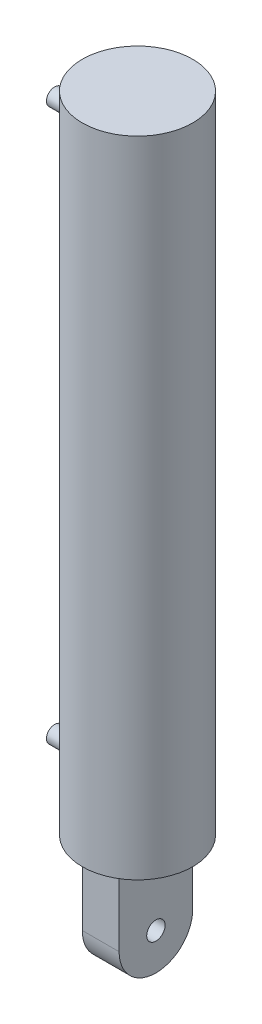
ISO-10303-21;
HEADER;
FILE_DESCRIPTION(('STEP AP214'),'2;1');
FILE_NAME('part.step','',(''),(''),'','','');
FILE_SCHEMA(('AUTOMOTIVE_DESIGN { 1 0 10303 214 1 1 1 1 }'));
ENDSEC;
DATA;
#1=APPLICATION_CONTEXT('core data for automotive mechanical design processes');
#2=APPLICATION_PROTOCOL_DEFINITION('international standard','automotive_design',2000,#1);
#3=PRODUCT_CONTEXT('',#1,'mechanical');
#4=PRODUCT('Part','Part','',(#3));
#5=PRODUCT_RELATED_PRODUCT_CATEGORY('part','',(#4));
#6=PRODUCT_DEFINITION_FORMATION('','',#4);
#7=PRODUCT_DEFINITION_CONTEXT('part definition',#1,'design');
#8=PRODUCT_DEFINITION('design','',#6,#7);
#9=PRODUCT_DEFINITION_SHAPE('','',#8);
#10=(LENGTH_UNIT() NAMED_UNIT(*) SI_UNIT(.MILLI.,.METRE.));
#11=(NAMED_UNIT(*) PLANE_ANGLE_UNIT() SI_UNIT($,.RADIAN.));
#12=(NAMED_UNIT(*) SI_UNIT($,.STERADIAN.) SOLID_ANGLE_UNIT());
#13=UNCERTAINTY_MEASURE_WITH_UNIT(LENGTH_MEASURE(1.E-05),#10,'distance_accuracy_value','');
#14=(GEOMETRIC_REPRESENTATION_CONTEXT(3) GLOBAL_UNCERTAINTY_ASSIGNED_CONTEXT((#13)) GLOBAL_UNIT_ASSIGNED_CONTEXT((#10,
#11,#12)) REPRESENTATION_CONTEXT('',''));
#15=CARTESIAN_POINT('',(0.,0.,0.));
#16=DIRECTION('',(0.,0.,1.));
#17=DIRECTION('',(1.,0.,0.));
#18=AXIS2_PLACEMENT_3D('',#15,#16,#17);
#19=CARTESIAN_POINT('',(0.,0.,0.));
#20=DIRECTION('',(0.,1.,0.));
#21=DIRECTION('',(0.,0.,1.));
#22=AXIS2_PLACEMENT_3D('',#19,#20,#21);
#23=PLANE('',#22);
#24=CARTESIAN_POINT('',(0.,0.,0.));
#25=DIRECTION('',(0.,1.,0.));
#26=DIRECTION('',(0.,0.,1.));
#27=AXIS2_PLACEMENT_3D('',#24,#25,#26);
#28=CIRCLE('',#27,60.);
#29=CARTESIAN_POINT('',(0.,0.,60.));
#30=VERTEX_POINT('',#29);
#31=EDGE_CURVE('E133',#30,#30,#28,.T.);
#32=ORIENTED_EDGE('',*,*,#31,.F.);
#33=EDGE_LOOP('',(#32));
#34=FACE_BOUND('',#33,.T.);
#35=DIRECTION('',(-1.,0.,0.));
#36=VECTOR('',#35,1.);
#37=CARTESIAN_POINT('',(-20.,0.,40.));
#38=LINE('',#37,#36);
#39=CARTESIAN_POINT('',(20.,0.,40.));
#40=VERTEX_POINT('',#39);
#41=CARTESIAN_POINT('',(-20.,0.,40.));
#42=VERTEX_POINT('',#41);
#43=EDGE_CURVE('E119',#40,#42,#38,.T.);
#44=ORIENTED_EDGE('',*,*,#43,.F.);
#45=DIRECTION('',(0.,0.,-1.));
#46=VECTOR('',#45,1.);
#47=CARTESIAN_POINT('',(20.,0.,40.));
#48=LINE('',#47,#46);
#49=CARTESIAN_POINT('',(20.,0.,-40.));
#50=VERTEX_POINT('',#49);
#51=EDGE_CURVE('E126',#40,#50,#48,.T.);
#52=ORIENTED_EDGE('',*,*,#51,.T.);
#53=DIRECTION('',(-1.,0.,0.));
#54=VECTOR('',#53,1.);
#55=CARTESIAN_POINT('',(-20.,0.,-40.));
#56=LINE('',#55,#54);
#57=CARTESIAN_POINT('',(-20.,0.,-40.));
#58=VERTEX_POINT('',#57);
#59=EDGE_CURVE('E144',#50,#58,#56,.T.);
#60=ORIENTED_EDGE('',*,*,#59,.T.);
#61=DIRECTION('',(0.,0.,-1.));
#62=VECTOR('',#61,1.);
#63=CARTESIAN_POINT('',(-20.,0.,40.));
#64=LINE('',#63,#62);
#65=EDGE_CURVE('E134',#42,#58,#64,.T.);
#66=ORIENTED_EDGE('',*,*,#65,.F.);
#67=EDGE_LOOP('',(#44,#52,#60,#66));
#68=FACE_BOUND('',#67,.T.);
#69=ADVANCED_FACE('F65',(#34,#68),#23,.F.);
#70=CARTESIAN_POINT('',(0.,700.,0.));
#71=DIRECTION('',(0.,-1.,0.));
#72=DIRECTION('',(0.,0.,-1.));
#73=AXIS2_PLACEMENT_3D('',#70,#71,#72);
#74=CYLINDRICAL_SURFACE('',#73,60.);
#75=CARTESIAN_POINT('',(-59.3211597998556,50.,-8.99999999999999));
#76=CARTESIAN_POINT('',(-59.3211583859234,50.2513237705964,-9.00000343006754));
#77=CARTESIAN_POINT('',(-59.3227601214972,50.5025995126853,-8.98946923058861));
#78=CARTESIAN_POINT('',(-59.3291177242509,51.0034271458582,-8.94741688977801));
#79=CARTESIAN_POINT('',(-59.3338742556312,51.2529786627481,-8.9158943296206));
#80=CARTESIAN_POINT('',(-59.3464108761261,51.7487007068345,-8.83206107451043));
#81=CARTESIAN_POINT('',(-59.3541935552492,51.9948681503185,-8.77973257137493));
#82=CARTESIAN_POINT('',(-59.3725563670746,52.4818658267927,-8.65468318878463));
#83=CARTESIAN_POINT('',(-59.3831365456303,52.7226959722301,-8.58196197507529));
#84=CARTESIAN_POINT('',(-59.4067802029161,53.1971284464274,-8.41673441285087));
#85=CARTESIAN_POINT('',(-59.4198417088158,53.430736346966,-8.32424377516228));
#86=CARTESIAN_POINT('',(-59.4480806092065,53.8893016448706,-8.12011829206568));
#87=CARTESIAN_POINT('',(-59.4632580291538,54.1142589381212,-8.00848321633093));
#88=CARTESIAN_POINT('',(-59.4952933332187,54.5538978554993,-7.76691084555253));
#89=CARTESIAN_POINT('',(-59.5121506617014,54.7685828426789,-7.63697959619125));
#90=CARTESIAN_POINT('',(-59.5470823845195,55.1863643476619,-7.35965424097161));
#91=CARTESIAN_POINT('',(-59.5651572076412,55.3894567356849,-7.21225396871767));
#92=CARTESIAN_POINT('',(-59.6021384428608,55.7839203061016,-6.89999774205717));
#93=CARTESIAN_POINT('',(-59.6210496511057,55.9752029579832,-6.73503050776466));
#94=CARTESIAN_POINT('',(-59.6590645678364,56.3433053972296,-6.38954003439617));
#95=CARTESIAN_POINT('',(-59.6781683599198,56.5201185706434,-6.20900975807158));
#96=CARTESIAN_POINT('',(-59.7160244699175,56.8579710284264,-5.83369420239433));
#97=CARTESIAN_POINT('',(-59.7347767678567,57.0190094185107,-5.63890811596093));
#98=CARTESIAN_POINT('',(-59.7713944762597,57.3241061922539,-5.23652450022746));
#99=CARTESIAN_POINT('',(-59.7892602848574,57.4681722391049,-5.02893281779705));
#100=CARTESIAN_POINT('',(-59.8237032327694,57.739097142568,-4.60117412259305));
#101=CARTESIAN_POINT('',(-59.8402731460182,57.8658620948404,-4.38094703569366));
#102=CARTESIAN_POINT('',(-59.8715441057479,58.1003268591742,-3.93053961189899));
#103=CARTESIAN_POINT('',(-59.8862458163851,58.2080334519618,-3.70036285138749));
#104=CARTESIAN_POINT('',(-59.9133710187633,58.4036550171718,-3.2315781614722));
#105=CARTESIAN_POINT('',(-59.9257941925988,58.4915672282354,-2.99296906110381));
#106=CARTESIAN_POINT('',(-59.9480048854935,58.6469188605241,-2.50905734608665));
#107=CARTESIAN_POINT('',(-59.9577924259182,58.7143584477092,-2.26375478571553));
#108=CARTESIAN_POINT('',(-59.9743889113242,58.8278227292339,-1.77008745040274));
#109=CARTESIAN_POINT('',(-59.9812196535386,58.8740043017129,-1.52175946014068));
#110=CARTESIAN_POINT('',(-59.9918152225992,58.9453418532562,-1.02203742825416));
#111=CARTESIAN_POINT('',(-59.9955800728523,58.9704979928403,-0.77064341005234));
#112=CARTESIAN_POINT('',(-59.9999369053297,58.9995909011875,-0.266615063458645));
#113=CARTESIAN_POINT('',(-60.0005290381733,59.0035286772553,-0.0139807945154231));
#114=CARTESIAN_POINT('',(-59.9985239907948,58.9901570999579,0.490711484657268));
#115=CARTESIAN_POINT('',(-59.9959268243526,58.9728478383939,0.742769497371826));
#116=CARTESIAN_POINT('',(-59.9876512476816,58.9173452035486,1.2424250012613));
#117=CARTESIAN_POINT('',(-59.9819983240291,58.8793245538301,1.490042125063));
#118=CARTESIAN_POINT('',(-59.9677833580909,58.7827853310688,1.98125077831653));
#119=CARTESIAN_POINT('',(-59.959220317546,58.724259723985,2.22484089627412));
#120=CARTESIAN_POINT('',(-59.9394255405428,58.5871607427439,2.70615509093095));
#121=CARTESIAN_POINT('',(-59.928194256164,58.5085907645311,2.94388015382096));
#122=CARTESIAN_POINT('',(-59.9033732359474,58.3319723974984,3.41185995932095));
#123=CARTESIAN_POINT('',(-59.8897834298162,58.2339234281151,3.64211447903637));
#124=CARTESIAN_POINT('',(-59.8605661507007,58.0186525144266,4.09440774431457));
#125=CARTESIAN_POINT('',(-59.8449312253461,57.9013600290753,4.31641243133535));
#126=CARTESIAN_POINT('',(-59.8120967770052,57.6486994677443,4.74976921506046));
#127=CARTESIAN_POINT('',(-59.7948972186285,57.5133309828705,4.96112107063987));
#128=CARTESIAN_POINT('',(-59.7594088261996,57.2254645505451,5.37173459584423));
#129=CARTESIAN_POINT('',(-59.7411199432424,57.0729658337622,5.57099572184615));
#130=CARTESIAN_POINT('',(-59.7039590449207,56.7518992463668,5.95606398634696));
#131=CARTESIAN_POINT('',(-59.6850870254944,56.5833312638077,6.14187103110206));
#132=CARTESIAN_POINT('',(-59.647095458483,56.229544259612,6.50052695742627));
#133=CARTESIAN_POINT('',(-59.6279753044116,56.0441775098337,6.67323008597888));
#134=CARTESIAN_POINT('',(-59.5902138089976,55.6595234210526,7.00241924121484));
#135=CARTESIAN_POINT('',(-59.571572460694,55.4602362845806,7.1589055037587));
#136=CARTESIAN_POINT('',(-59.5352972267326,55.0491122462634,7.45456750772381));
#137=CARTESIAN_POINT('',(-59.5176633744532,54.837274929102,7.59374267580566));
#138=CARTESIAN_POINT('',(-59.4839084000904,54.402534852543,7.85377865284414));
#139=CARTESIAN_POINT('',(-59.4677872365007,54.1796323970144,7.97463996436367));
#140=CARTESIAN_POINT('',(-59.4375064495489,53.7240924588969,8.19728427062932));
#141=CARTESIAN_POINT('',(-59.4233487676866,53.4914456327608,8.29904841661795));
#142=CARTESIAN_POINT('',(-59.3974300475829,53.0183530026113,8.48256419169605));
#143=CARTESIAN_POINT('',(-59.385668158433,52.7779100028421,8.56432292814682));
#144=CARTESIAN_POINT('',(-59.3648778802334,52.2908358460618,8.70726690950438));
#145=CARTESIAN_POINT('',(-59.3558498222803,52.0442039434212,8.76844966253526));
#146=CARTESIAN_POINT('',(-59.3407954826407,51.5465629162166,8.86975867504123));
#147=CARTESIAN_POINT('',(-59.3347691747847,51.2955538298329,8.90988511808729));
#148=CARTESIAN_POINT('',(-59.325939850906,50.7934345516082,8.96848543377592));
#149=CARTESIAN_POINT('',(-59.3231061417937,50.5423489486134,8.98716552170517));
#150=CARTESIAN_POINT('',(-59.3206401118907,50.039480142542,9.00342854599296));
#151=CARTESIAN_POINT('',(-59.321007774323,49.787696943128,9.00101159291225));
#152=CARTESIAN_POINT('',(-59.3249336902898,49.2852507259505,8.97509960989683));
#153=CARTESIAN_POINT('',(-59.3284918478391,49.0345876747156,8.95160521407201));
#154=CARTESIAN_POINT('',(-59.3386948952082,48.5361718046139,8.88371901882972));
#155=CARTESIAN_POINT('',(-59.3453397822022,48.2884189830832,8.83932723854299));
#156=CARTESIAN_POINT('',(-59.3614811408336,47.7988664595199,8.73026770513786));
#157=CARTESIAN_POINT('',(-59.3709626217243,47.5570425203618,8.66570646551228));
#158=CARTESIAN_POINT('',(-59.3925218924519,47.079632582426,8.51668993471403));
#159=CARTESIAN_POINT('',(-59.4046005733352,46.8440487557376,8.43222781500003));
#160=CARTESIAN_POINT('',(-59.4310072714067,46.3808725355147,8.24405200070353));
#161=CARTESIAN_POINT('',(-59.4453349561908,46.1532789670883,8.14034115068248));
#162=CARTESIAN_POINT('',(-59.4758376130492,45.7076003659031,7.91440004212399));
#163=CARTESIAN_POINT('',(-59.4920126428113,45.4895156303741,7.79216920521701));
#164=CARTESIAN_POINT('',(-59.5258841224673,45.0627463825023,7.52906607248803));
#165=CARTESIAN_POINT('',(-59.5435910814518,44.8541447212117,7.38806073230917));
#166=CARTESIAN_POINT('',(-59.5799220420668,44.4495297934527,7.08911513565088));
#167=CARTESIAN_POINT('',(-59.5985460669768,44.2535168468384,6.93117444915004));
#168=CARTESIAN_POINT('',(-59.6361896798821,43.8754171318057,6.59944976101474));
#169=CARTESIAN_POINT('',(-59.6552092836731,43.6933309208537,6.42566512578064));
#170=CARTESIAN_POINT('',(-59.6931126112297,43.3443413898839,6.06345257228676));
#171=CARTESIAN_POINT('',(-59.7119963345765,43.1774381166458,5.87502460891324));
#172=CARTESIAN_POINT('',(-59.7492573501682,42.8586393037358,5.48318258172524));
#173=CARTESIAN_POINT('',(-59.7676290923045,42.7068808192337,5.27965645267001));
#174=CARTESIAN_POINT('',(-59.8031797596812,42.4210537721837,4.86044564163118));
#175=CARTESIAN_POINT('',(-59.8203587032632,42.2869849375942,4.64476114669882));
#176=CARTESIAN_POINT('',(-59.8530375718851,42.0374998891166,4.20273703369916));
#177=CARTESIAN_POINT('',(-59.8685374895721,41.9220837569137,3.97639736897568));
#178=CARTESIAN_POINT('',(-59.8974175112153,41.7107546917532,3.5146654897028));
#179=CARTESIAN_POINT('',(-59.9107976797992,41.6148411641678,3.27927355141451));
#180=CARTESIAN_POINT('',(-59.9350149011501,41.443529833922,2.80194405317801));
#181=CARTESIAN_POINT('',(-59.9458606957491,41.3680613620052,2.56003230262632));
#182=CARTESIAN_POINT('',(-59.964757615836,41.2377906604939,2.07069292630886));
#183=CARTESIAN_POINT('',(-59.9728097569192,41.1829809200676,1.82326733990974));
#184=CARTESIAN_POINT('',(-59.9858962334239,41.0944023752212,1.32456638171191));
#185=CARTESIAN_POINT('',(-59.9909301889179,41.0606362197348,1.07329052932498));
#186=CARTESIAN_POINT('',(-59.9978348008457,41.0144168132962,0.568743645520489));
#187=CARTESIAN_POINT('',(-59.9997054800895,41.0019634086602,0.31547262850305));
#188=CARTESIAN_POINT('',(-60.0002275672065,40.9984829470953,-0.188685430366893));
#189=CARTESIAN_POINT('',(-59.9989109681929,41.0072429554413,-0.439570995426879));
#190=CARTESIAN_POINT('',(-59.9931611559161,41.0456856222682,-0.9397865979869));
#191=CARTESIAN_POINT('',(-59.9887268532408,41.0753755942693,-1.18911606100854));
#192=CARTESIAN_POINT('',(-59.9768659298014,41.1554530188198,-1.68430493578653));
#193=CARTESIAN_POINT('',(-59.969439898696,41.2058363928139,-1.93016502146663));
#194=CARTESIAN_POINT('',(-59.9518029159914,41.326923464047,-2.41673292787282));
#195=CARTESIAN_POINT('',(-59.9415918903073,41.397627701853,-2.6574406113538));
#196=CARTESIAN_POINT('',(-59.918678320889,41.5587701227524,-3.1318274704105));
#197=CARTESIAN_POINT('',(-59.9059776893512,41.6491931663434,-3.36551188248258));
#198=CARTESIAN_POINT('',(-59.8784317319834,41.8491481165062,-3.82442967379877));
#199=CARTESIAN_POINT('',(-59.8635863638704,41.958680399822,-4.04966288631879));
#200=CARTESIAN_POINT('',(-59.8321609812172,42.19607007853,-4.49013029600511));
#201=CARTESIAN_POINT('',(-59.8155809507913,42.3239276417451,-4.70536440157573));
#202=CARTESIAN_POINT('',(-59.7811428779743,42.5970687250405,-5.12436852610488));
#203=CARTESIAN_POINT('',(-59.763284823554,42.7423524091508,-5.32813843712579));
#204=CARTESIAN_POINT('',(-59.7266105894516,43.0507792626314,-5.72468463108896));
#205=CARTESIAN_POINT('',(-59.7077869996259,43.2140770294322,-5.91734000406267));
#206=CARTESIAN_POINT('',(-59.6698656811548,43.5562608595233,-6.28823414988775));
#207=CARTESIAN_POINT('',(-59.6507679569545,43.7351466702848,-6.4664731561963));
#208=CARTESIAN_POINT('',(-59.6128290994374,44.1073213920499,-6.80735135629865));
#209=CARTESIAN_POINT('',(-59.5939880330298,44.3006139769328,-6.9699865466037));
#210=CARTESIAN_POINT('',(-59.5570989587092,44.700225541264,-7.27846841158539));
#211=CARTESIAN_POINT('',(-59.5390509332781,44.9065442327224,-7.42431545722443));
#212=CARTESIAN_POINT('',(-59.5041574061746,45.3320289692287,-7.69899598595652));
#213=CARTESIAN_POINT('',(-59.4873195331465,45.5512629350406,-7.82772526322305));
#214=CARTESIAN_POINT('',(-59.4554551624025,45.999852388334,-8.06618387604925));
#215=CARTESIAN_POINT('',(-59.4404279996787,46.2292041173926,-8.17592019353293));
#216=CARTESIAN_POINT('',(-59.4126250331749,46.6963195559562,-8.37556870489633));
#217=CARTESIAN_POINT('',(-59.3998475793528,46.9340769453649,-8.46549544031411));
#218=CARTESIAN_POINT('',(-59.3769065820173,47.4163806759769,-8.62493085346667));
#219=CARTESIAN_POINT('',(-59.3667424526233,47.6609254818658,-8.69444410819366));
#220=CARTESIAN_POINT('',(-59.3459809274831,48.2501176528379,-8.83524234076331));
#221=CARTESIAN_POINT('',(-59.3367159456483,48.597144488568,-8.89695732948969));
#222=CARTESIAN_POINT('',(-59.3243064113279,49.2961456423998,-8.97933349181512));
#223=CARTESIAN_POINT('',(-59.3211617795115,49.6481198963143,-8.99999519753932));
#224=CARTESIAN_POINT('',(-59.3211597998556,50.,-8.99999999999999));
#225=B_SPLINE_CURVE_WITH_KNOTS('',3,(#75,#76,#77,#78,#79,#80,#81,#82,#83,#84,#85,#86,#87,#88,
#89,#90,#91,#92,#93,#94,#95,#96,#97,#98,#99,#100,#101,#102,#103,#104,#105,#106,#107,#108,#109,
#110,#111,#112,#113,#114,#115,#116,#117,#118,#119,#120,#121,#122,#123,#124,#125,#126,#127,#128,
#129,#130,#131,#132,#133,#134,#135,#136,#137,#138,#139,#140,#141,#142,#143,#144,#145,#146,#147,
#148,#149,#150,#151,#152,#153,#154,#155,#156,#157,#158,#159,#160,#161,#162,#163,#164,#165,#166,
#167,#168,#169,#170,#171,#172,#173,#174,#175,#176,#177,#178,#179,#180,#181,#182,#183,#184,#185,
#186,#187,#188,#189,#190,#191,#192,#193,#194,#195,#196,#197,#198,#199,#200,#201,#202,#203,#204,
#205,#206,#207,#208,#209,#210,#211,#212,#213,#214,#215,#216,#217,#218,#219,#220,#221,#222,#223,
#224),.UNSPECIFIED.,.T.,.F.,(4,2,2,2,2,2,2,2,2,2,2,2,2,2,2,2,2,2,2,2,2,2,2,2,2,2,2,2,2,2,2,2,2,
2,2,2,2,2,2,2,2,2,2,2,2,2,2,2,2,2,2,2,2,2,2,2,2,2,2,2,2,2,2,2,2,2,2,2,2,2,2,2,2,2,4),(0.,
0.753662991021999,1.50748470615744,2.26195302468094,3.01643371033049,3.77031702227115,
4.5242094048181,5.27785325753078,6.03176393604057,6.79077179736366,7.55012468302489,
8.30952059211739,9.06857230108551,9.83159263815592,10.594340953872,11.3571956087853,
12.1200440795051,12.8771689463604,13.6342880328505,14.3913711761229,15.1484510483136,
15.8993117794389,16.6504303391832,17.4014217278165,18.1524355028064,18.9062664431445,
19.6601144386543,20.4139963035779,21.1678834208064,21.9292003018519,22.6905061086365,
23.4518371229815,24.2131472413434,24.975204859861,25.7369913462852,26.4988700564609,
27.2607421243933,28.0152254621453,28.7697048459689,29.5241615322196,30.2786175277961,
31.0291547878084,31.7799499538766,32.5306342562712,33.2813420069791,34.0376849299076,
34.7940470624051,35.5504394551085,36.3068341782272,37.0695492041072,37.8322524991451,
38.5949591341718,39.3576425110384,40.1176549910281,40.8773908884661,41.6372224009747,
42.3970484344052,43.1492792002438,43.901772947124,44.65411845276,45.4064839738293,
46.1582738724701,46.9100785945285,47.6618902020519,48.4137088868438,49.172572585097,
49.9314239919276,50.6904695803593,51.4494983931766,52.2129547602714,52.9761298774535,
53.7387428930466,54.5011847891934,55.5564070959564,56.6116157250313),.UNSPECIFIED.);
#226=CARTESIAN_POINT('',(-59.3211597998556,50.,-8.99999999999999));
#227=VERTEX_POINT('',#226);
#228=EDGE_CURVE('E69',#227,#227,#225,.T.);
#229=ORIENTED_EDGE('',*,*,#228,.T.);
#230=EDGE_LOOP('',(#229));
#231=FACE_BOUND('',#230,.T.);
#232=CARTESIAN_POINT('',(-59.3211597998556,650.,-9.00000000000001));
#233=CARTESIAN_POINT('',(-59.3211583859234,650.251323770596,-9.00000343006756));
#234=CARTESIAN_POINT('',(-59.3227601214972,650.502599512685,-8.98946923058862));
#235=CARTESIAN_POINT('',(-59.3291177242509,651.003427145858,-8.94741688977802));
#236=CARTESIAN_POINT('',(-59.3338742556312,651.252978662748,-8.91589432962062));
#237=CARTESIAN_POINT('',(-59.3464108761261,651.748700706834,-8.83206107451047));
#238=CARTESIAN_POINT('',(-59.3541935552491,651.994868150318,-8.77973257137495));
#239=CARTESIAN_POINT('',(-59.3725563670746,652.481865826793,-8.65468318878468));
#240=CARTESIAN_POINT('',(-59.3831365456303,652.72269597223,-8.58196197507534));
#241=CARTESIAN_POINT('',(-59.4067802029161,653.197128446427,-8.41673441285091));
#242=CARTESIAN_POINT('',(-59.4198417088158,653.430736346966,-8.32424377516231));
#243=CARTESIAN_POINT('',(-59.4480806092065,653.88930164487,-8.12011829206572));
#244=CARTESIAN_POINT('',(-59.4632580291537,654.114258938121,-8.008483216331));
#245=CARTESIAN_POINT('',(-59.4952933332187,654.553897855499,-7.76691084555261));
#246=CARTESIAN_POINT('',(-59.5121506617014,654.768582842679,-7.63697959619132));
#247=CARTESIAN_POINT('',(-59.5470823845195,655.186364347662,-7.35965424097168));
#248=CARTESIAN_POINT('',(-59.5651572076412,655.389456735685,-7.21225396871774));
#249=CARTESIAN_POINT('',(-59.6021384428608,655.783920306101,-6.89999774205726));
#250=CARTESIAN_POINT('',(-59.6210496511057,655.975202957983,-6.73503050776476));
#251=CARTESIAN_POINT('',(-59.6590645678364,656.343305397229,-6.38954003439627));
#252=CARTESIAN_POINT('',(-59.6781683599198,656.520118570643,-6.2090097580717));
#253=CARTESIAN_POINT('',(-59.7160244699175,656.857971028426,-5.83369420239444));
#254=CARTESIAN_POINT('',(-59.7347767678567,657.01900941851,-5.63890811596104));
#255=CARTESIAN_POINT('',(-59.7713944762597,657.324106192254,-5.23652450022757));
#256=CARTESIAN_POINT('',(-59.7892602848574,657.468172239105,-5.02893281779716));
#257=CARTESIAN_POINT('',(-59.8237032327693,657.739097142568,-4.60117412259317));
#258=CARTESIAN_POINT('',(-59.8402731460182,657.86586209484,-4.3809470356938));
#259=CARTESIAN_POINT('',(-59.8715441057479,658.100326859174,-3.93053961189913));
#260=CARTESIAN_POINT('',(-59.8862458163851,658.208033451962,-3.70036285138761));
#261=CARTESIAN_POINT('',(-59.9133710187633,658.403655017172,-3.23157816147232));
#262=CARTESIAN_POINT('',(-59.9257941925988,658.491567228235,-2.99296906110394));
#263=CARTESIAN_POINT('',(-59.9480048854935,658.646918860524,-2.5090573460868));
#264=CARTESIAN_POINT('',(-59.9577924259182,658.714358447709,-2.26375478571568));
#265=CARTESIAN_POINT('',(-59.9743889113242,658.827822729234,-1.77008745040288));
#266=CARTESIAN_POINT('',(-59.9812196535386,658.874004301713,-1.52175946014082));
#267=CARTESIAN_POINT('',(-59.9918152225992,658.945341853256,-1.0220374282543));
#268=CARTESIAN_POINT('',(-59.9955800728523,658.97049799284,-0.770643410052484));
#269=CARTESIAN_POINT('',(-59.9999369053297,658.999590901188,-0.266615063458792));
#270=CARTESIAN_POINT('',(-60.0005290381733,659.003528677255,-0.0139807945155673));
#271=CARTESIAN_POINT('',(-59.9985239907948,658.990157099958,0.490711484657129));
#272=CARTESIAN_POINT('',(-59.9959268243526,658.972847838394,0.742769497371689));
#273=CARTESIAN_POINT('',(-59.9876512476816,658.917345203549,1.24242500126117));
#274=CARTESIAN_POINT('',(-59.9819983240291,658.87932455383,1.49004212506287));
#275=CARTESIAN_POINT('',(-59.9677833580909,658.782785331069,1.98125077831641));
#276=CARTESIAN_POINT('',(-59.9592203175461,658.724259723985,2.22484089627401));
#277=CARTESIAN_POINT('',(-59.9394255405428,658.587160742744,2.70615509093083));
#278=CARTESIAN_POINT('',(-59.928194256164,658.508590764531,2.94388015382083));
#279=CARTESIAN_POINT('',(-59.9033732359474,658.331972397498,3.41185995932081));
#280=CARTESIAN_POINT('',(-59.8897834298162,658.233923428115,3.64211447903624));
#281=CARTESIAN_POINT('',(-59.8605661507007,658.018652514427,4.09440774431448));
#282=CARTESIAN_POINT('',(-59.8449312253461,657.901360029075,4.3164124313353));
#283=CARTESIAN_POINT('',(-59.8120967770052,657.648699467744,4.74976921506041));
#284=CARTESIAN_POINT('',(-59.7948972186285,657.51333098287,4.96112107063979));
#285=CARTESIAN_POINT('',(-59.7594088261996,657.225464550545,5.37173459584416));
#286=CARTESIAN_POINT('',(-59.7411199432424,657.072965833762,5.57099572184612));
#287=CARTESIAN_POINT('',(-59.7039590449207,656.751899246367,5.95606398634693));
#288=CARTESIAN_POINT('',(-59.6850870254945,656.583331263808,6.141871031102));
#289=CARTESIAN_POINT('',(-59.647095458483,656.229544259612,6.5005269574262));
#290=CARTESIAN_POINT('',(-59.6279753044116,656.044177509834,6.67323008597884));
#291=CARTESIAN_POINT('',(-59.5902138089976,655.659523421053,7.00241924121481));
#292=CARTESIAN_POINT('',(-59.571572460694,655.460236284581,7.15890550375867));
#293=CARTESIAN_POINT('',(-59.5352972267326,655.049112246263,7.45456750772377));
#294=CARTESIAN_POINT('',(-59.5176633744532,654.837274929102,7.59374267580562));
#295=CARTESIAN_POINT('',(-59.4839084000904,654.402534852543,7.8537786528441));
#296=CARTESIAN_POINT('',(-59.4677872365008,654.179632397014,7.97463996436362));
#297=CARTESIAN_POINT('',(-59.4375064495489,653.724092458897,8.19728427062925));
#298=CARTESIAN_POINT('',(-59.4233487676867,653.491445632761,8.29904841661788));
#299=CARTESIAN_POINT('',(-59.3974300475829,653.018353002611,8.48256419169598));
#300=CARTESIAN_POINT('',(-59.385668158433,652.777910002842,8.56432292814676));
#301=CARTESIAN_POINT('',(-59.3648778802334,652.290835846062,8.70726690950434));
#302=CARTESIAN_POINT('',(-59.3558498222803,652.044203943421,8.76844966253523));
#303=CARTESIAN_POINT('',(-59.3407954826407,651.546562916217,8.86975867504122));
#304=CARTESIAN_POINT('',(-59.3347691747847,651.295553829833,8.90988511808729));
#305=CARTESIAN_POINT('',(-59.325939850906,650.793434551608,8.96848543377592));
#306=CARTESIAN_POINT('',(-59.3231061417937,650.542348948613,8.98716552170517));
#307=CARTESIAN_POINT('',(-59.3206401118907,650.039480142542,9.00342854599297));
#308=CARTESIAN_POINT('',(-59.321007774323,649.787696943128,9.00101159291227));
#309=CARTESIAN_POINT('',(-59.3249336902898,649.285250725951,8.97509960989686));
#310=CARTESIAN_POINT('',(-59.3284918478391,649.034587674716,8.95160521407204));
#311=CARTESIAN_POINT('',(-59.3386948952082,648.536171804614,8.88371901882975));
#312=CARTESIAN_POINT('',(-59.3453397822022,648.288418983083,8.83932723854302));
#313=CARTESIAN_POINT('',(-59.3614811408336,647.79886645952,8.7302677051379));
#314=CARTESIAN_POINT('',(-59.3709626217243,647.557042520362,8.66570646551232));
#315=CARTESIAN_POINT('',(-59.3925218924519,647.079632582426,8.51668993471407));
#316=CARTESIAN_POINT('',(-59.4046005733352,646.844048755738,8.43222781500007));
#317=CARTESIAN_POINT('',(-59.4310072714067,646.380872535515,8.24405200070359));
#318=CARTESIAN_POINT('',(-59.4453349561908,646.153278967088,8.14034115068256));
#319=CARTESIAN_POINT('',(-59.4758376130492,645.707600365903,7.91440004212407));
#320=CARTESIAN_POINT('',(-59.4920126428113,645.489515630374,7.79216920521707));
#321=CARTESIAN_POINT('',(-59.5258841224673,645.062746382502,7.52906607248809));
#322=CARTESIAN_POINT('',(-59.5435910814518,644.854144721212,7.38806073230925));
#323=CARTESIAN_POINT('',(-59.5799220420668,644.449529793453,7.08911513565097));
#324=CARTESIAN_POINT('',(-59.5985460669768,644.253516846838,6.93117444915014));
#325=CARTESIAN_POINT('',(-59.6361896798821,643.875417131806,6.59944976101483));
#326=CARTESIAN_POINT('',(-59.6552092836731,643.693330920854,6.42566512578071));
#327=CARTESIAN_POINT('',(-59.6931126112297,643.344341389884,6.06345257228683));
#328=CARTESIAN_POINT('',(-59.7119963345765,643.177438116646,5.87502460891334));
#329=CARTESIAN_POINT('',(-59.7492573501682,642.858639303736,5.48318258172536));
#330=CARTESIAN_POINT('',(-59.7676290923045,642.706880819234,5.27965645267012));
#331=CARTESIAN_POINT('',(-59.8031797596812,642.421053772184,4.86044564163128));
#332=CARTESIAN_POINT('',(-59.8203587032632,642.286984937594,4.64476114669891));
#333=CARTESIAN_POINT('',(-59.8530375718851,642.037499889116,4.20273703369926));
#334=CARTESIAN_POINT('',(-59.8685374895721,641.922083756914,3.9763973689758));
#335=CARTESIAN_POINT('',(-59.8974175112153,641.710754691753,3.51466548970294));
#336=CARTESIAN_POINT('',(-59.9107976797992,641.614841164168,3.27927355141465));
#337=CARTESIAN_POINT('',(-59.9350149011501,641.443529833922,2.80194405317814));
#338=CARTESIAN_POINT('',(-59.945860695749,641.368061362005,2.56003230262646));
#339=CARTESIAN_POINT('',(-59.9647576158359,641.237790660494,2.070692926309));
#340=CARTESIAN_POINT('',(-59.9728097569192,641.182980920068,1.82326733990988));
#341=CARTESIAN_POINT('',(-59.9858962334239,641.094402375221,1.32456638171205));
#342=CARTESIAN_POINT('',(-59.9909301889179,641.060636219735,1.07329052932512));
#343=CARTESIAN_POINT('',(-59.9978348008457,641.014416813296,0.568743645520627));
#344=CARTESIAN_POINT('',(-59.9997054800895,641.00196340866,0.315472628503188));
#345=CARTESIAN_POINT('',(-60.0002275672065,640.998482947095,-0.18868543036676));
#346=CARTESIAN_POINT('',(-59.9989109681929,641.007242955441,-0.439570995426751));
#347=CARTESIAN_POINT('',(-59.9931611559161,641.045685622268,-0.939786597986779));
#348=CARTESIAN_POINT('',(-59.9887268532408,641.075375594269,-1.18911606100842));
#349=CARTESIAN_POINT('',(-59.9768659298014,641.15545301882,-1.68430493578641));
#350=CARTESIAN_POINT('',(-59.969439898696,641.205836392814,-1.93016502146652));
#351=CARTESIAN_POINT('',(-59.9518029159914,641.326923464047,-2.4167329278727));
#352=CARTESIAN_POINT('',(-59.9415918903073,641.397627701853,-2.65744061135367));
#353=CARTESIAN_POINT('',(-59.918678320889,641.558770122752,-3.13182747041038));
#354=CARTESIAN_POINT('',(-59.9059776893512,641.649193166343,-3.36551188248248));
#355=CARTESIAN_POINT('',(-59.8784317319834,641.849148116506,-3.82442967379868));
#356=CARTESIAN_POINT('',(-59.8635863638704,641.958680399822,-4.04966288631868));
#357=CARTESIAN_POINT('',(-59.8321609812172,642.19607007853,-4.490130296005));
#358=CARTESIAN_POINT('',(-59.8155809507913,642.323927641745,-4.70536440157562));
#359=CARTESIAN_POINT('',(-59.7811428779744,642.59706872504,-5.12436852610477));
#360=CARTESIAN_POINT('',(-59.7632848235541,642.742352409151,-5.32813843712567));
#361=CARTESIAN_POINT('',(-59.7266105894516,643.050779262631,-5.72468463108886));
#362=CARTESIAN_POINT('',(-59.7077869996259,643.214077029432,-5.91734000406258));
#363=CARTESIAN_POINT('',(-59.6698656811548,643.556260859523,-6.28823414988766));
#364=CARTESIAN_POINT('',(-59.6507679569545,643.735146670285,-6.46647315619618));
#365=CARTESIAN_POINT('',(-59.6128290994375,644.10732139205,-6.80735135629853));
#366=CARTESIAN_POINT('',(-59.5939880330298,644.300613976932,-6.96998654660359));
#367=CARTESIAN_POINT('',(-59.5570989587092,644.700225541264,-7.2784684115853));
#368=CARTESIAN_POINT('',(-59.5390509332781,644.906544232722,-7.42431545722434));
#369=CARTESIAN_POINT('',(-59.5041574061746,645.332028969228,-7.6989959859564));
#370=CARTESIAN_POINT('',(-59.4873195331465,645.55126293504,-7.82772526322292));
#371=CARTESIAN_POINT('',(-59.4554551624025,645.999852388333,-8.06618387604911));
#372=CARTESIAN_POINT('',(-59.4404279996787,646.229204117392,-8.17592019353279));
#373=CARTESIAN_POINT('',(-59.412625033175,646.696319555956,-8.3755687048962));
#374=CARTESIAN_POINT('',(-59.3998475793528,646.934076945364,-8.46549544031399));
#375=CARTESIAN_POINT('',(-59.3769065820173,647.416380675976,-8.6249308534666));
#376=CARTESIAN_POINT('',(-59.3667424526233,647.660925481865,-8.69444410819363));
#377=CARTESIAN_POINT('',(-59.3459809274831,648.250117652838,-8.83524234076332));
#378=CARTESIAN_POINT('',(-59.3367159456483,648.597144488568,-8.89695732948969));
#379=CARTESIAN_POINT('',(-59.3243064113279,649.2961456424,-8.97933349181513));
#380=CARTESIAN_POINT('',(-59.3211617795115,649.648119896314,-8.99999519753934));
#381=CARTESIAN_POINT('',(-59.3211597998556,650.,-9.00000000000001));
#382=B_SPLINE_CURVE_WITH_KNOTS('',3,(#232,#233,#234,#235,#236,#237,#238,#239,#240,#241,#242,
#243,#244,#245,#246,#247,#248,#249,#250,#251,#252,#253,#254,#255,#256,#257,#258,#259,#260,#261,
#262,#263,#264,#265,#266,#267,#268,#269,#270,#271,#272,#273,#274,#275,#276,#277,#278,#279,#280,
#281,#282,#283,#284,#285,#286,#287,#288,#289,#290,#291,#292,#293,#294,#295,#296,#297,#298,#299,
#300,#301,#302,#303,#304,#305,#306,#307,#308,#309,#310,#311,#312,#313,#314,#315,#316,#317,#318,
#319,#320,#321,#322,#323,#324,#325,#326,#327,#328,#329,#330,#331,#332,#333,#334,#335,#336,#337,
#338,#339,#340,#341,#342,#343,#344,#345,#346,#347,#348,#349,#350,#351,#352,#353,#354,#355,#356,
#357,#358,#359,#360,#361,#362,#363,#364,#365,#366,#367,#368,#369,#370,#371,#372,#373,#374,#375,
#376,#377,#378,#379,#380,#381),.UNSPECIFIED.,.T.,.F.,(4,2,2,2,2,2,2,2,2,2,2,2,2,2,2,2,2,2,2,2,2,
2,2,2,2,2,2,2,2,2,2,2,2,2,2,2,2,2,2,2,2,2,2,2,2,2,2,2,2,2,2,2,2,2,2,2,2,2,2,2,2,2,2,2,2,2,2,2,2,
2,2,2,2,2,4),(0.,0.753662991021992,1.50748470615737,2.2619530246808,3.0164337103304,
3.77031702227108,4.52420940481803,5.27785325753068,6.03176393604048,6.79077179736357,
7.55012468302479,8.30952059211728,9.06857230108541,9.83159263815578,10.5943409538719,
11.3571956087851,12.1200440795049,12.8771689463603,13.6342880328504,14.3913711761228,
15.1484510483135,15.8993117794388,16.6504303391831,17.4014217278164,18.1524355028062,
18.9062664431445,19.6601144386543,20.413996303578,21.1678834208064,21.9292003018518,
22.6905061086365,23.4518371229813,24.2131472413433,24.9752048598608,25.7369913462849,
26.4988700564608,27.2607421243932,28.0152254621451,28.7697048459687,29.5241615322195,
30.278617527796,31.0291547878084,31.7799499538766,32.5306342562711,33.281342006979,
34.0376849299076,34.794047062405,35.5504394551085,36.3068341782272,37.0695492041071,
37.8322524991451,38.5949591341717,39.3576425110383,40.117654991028,40.877390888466,
41.6372224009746,42.3970484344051,43.1492792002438,43.901772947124,44.6541184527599,
45.4064839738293,46.15827387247,46.9100785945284,47.6618902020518,48.4137088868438,
49.1725725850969,49.9314239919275,50.6904695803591,51.4494983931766,52.2129547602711,
52.9761298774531,53.7387428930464,54.5011847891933,55.5564070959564,56.6116157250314),.UNSPECIFIED.);
#383=CARTESIAN_POINT('',(-59.3211597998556,650.,-9.00000000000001));
#384=VERTEX_POINT('',#383);
#385=EDGE_CURVE('E168',#384,#384,#382,.T.);
#386=ORIENTED_EDGE('',*,*,#385,.T.);
#387=EDGE_LOOP('',(#386));
#388=FACE_BOUND('',#387,.T.);
#389=CARTESIAN_POINT('',(0.,700.,0.));
#390=DIRECTION('',(0.,1.,0.));
#391=DIRECTION('',(0.,0.,1.));
#392=AXIS2_PLACEMENT_3D('',#389,#390,#391);
#393=CIRCLE('',#392,60.);
#394=CARTESIAN_POINT('',(0.,700.,60.));
#395=VERTEX_POINT('',#394);
#396=EDGE_CURVE('E149',#395,#395,#393,.T.);
#397=ORIENTED_EDGE('',*,*,#396,.F.);
#398=EDGE_LOOP('',(#397));
#399=FACE_BOUND('',#398,.T.);
#400=ORIENTED_EDGE('',*,*,#31,.T.);
#401=EDGE_LOOP('',(#400));
#402=FACE_BOUND('',#401,.T.);
#403=ADVANCED_FACE('F175',(#231,#388,#399,#402),#74,.T.);
#404=CARTESIAN_POINT('',(0.,700.,0.));
#405=DIRECTION('',(0.,1.,0.));
#406=DIRECTION('',(0.,0.,1.));
#407=AXIS2_PLACEMENT_3D('',#404,#405,#406);
#408=PLANE('',#407);
#409=ORIENTED_EDGE('',*,*,#396,.T.);
#410=EDGE_LOOP('',(#409));
#411=FACE_BOUND('',#410,.T.);
#412=ADVANCED_FACE('F207',(#411),#408,.T.);
#413=CARTESIAN_POINT('',(20.,-120.,40.));
#414=DIRECTION('',(-1.,0.,0.));
#415=DIRECTION('',(0.,-1.,0.));
#416=AXIS2_PLACEMENT_3D('',#413,#414,#415);
#417=PLANE('',#416);
#418=CARTESIAN_POINT('',(20.,-80.,0.));
#419=DIRECTION('',(1.,0.,0.));
#420=DIRECTION('',(0.,1.,0.));
#421=AXIS2_PLACEMENT_3D('',#418,#419,#420);
#422=CIRCLE('',#421,10.);
#423=CARTESIAN_POINT('',(20.,-70.,0.));
#424=VERTEX_POINT('',#423);
#425=EDGE_CURVE('E167',#424,#424,#422,.T.);
#426=ORIENTED_EDGE('',*,*,#425,.F.);
#427=EDGE_LOOP('',(#426));
#428=FACE_BOUND('',#427,.T.);
#429=CARTESIAN_POINT('',(20.,-80.,0.));
#430=DIRECTION('',(-1.,0.,0.));
#431=DIRECTION('',(0.,-1.,0.));
#432=AXIS2_PLACEMENT_3D('',#429,#430,#431);
#433=CIRCLE('',#432,40.);
#434=CARTESIAN_POINT('',(20.,-80.,40.));
#435=VERTEX_POINT('',#434);
#436=CARTESIAN_POINT('',(20.,-120.,0.));
#437=VERTEX_POINT('',#436);
#438=EDGE_CURVE('E152',#435,#437,#433,.F.);
#439=ORIENTED_EDGE('',*,*,#438,.T.);
#440=CARTESIAN_POINT('',(20.,-80.,0.));
#441=DIRECTION('',(-1.,0.,0.));
#442=DIRECTION('',(0.,-1.,0.));
#443=AXIS2_PLACEMENT_3D('',#440,#441,#442);
#444=CIRCLE('',#443,40.);
#445=CARTESIAN_POINT('',(20.,-80.,-40.));
#446=VERTEX_POINT('',#445);
#447=EDGE_CURVE('E156',#437,#446,#444,.F.);
#448=ORIENTED_EDGE('',*,*,#447,.T.);
#449=DIRECTION('',(0.,1.,0.));
#450=VECTOR('',#449,1.);
#451=CARTESIAN_POINT('',(20.,-120.,-40.));
#452=LINE('',#451,#450);
#453=EDGE_CURVE('E129',#446,#50,#452,.T.);
#454=ORIENTED_EDGE('',*,*,#453,.T.);
#455=ORIENTED_EDGE('',*,*,#51,.F.);
#456=DIRECTION('',(0.,1.,0.));
#457=VECTOR('',#456,1.);
#458=CARTESIAN_POINT('',(20.,-120.,40.));
#459=LINE('',#458,#457);
#460=EDGE_CURVE('E115',#435,#40,#459,.T.);
#461=ORIENTED_EDGE('',*,*,#460,.F.);
#462=EDGE_LOOP('',(#439,#448,#454,#455,#461));
#463=FACE_BOUND('',#462,.T.);
#464=ADVANCED_FACE('F127',(#428,#463),#417,.F.);
#465=CARTESIAN_POINT('',(-20.,-120.,40.));
#466=DIRECTION('',(1.,0.,0.));
#467=DIRECTION('',(0.,1.,0.));
#468=AXIS2_PLACEMENT_3D('',#465,#466,#467);
#469=PLANE('',#468);
#470=CARTESIAN_POINT('',(-20.,-80.,0.));
#471=DIRECTION('',(1.,0.,0.));
#472=DIRECTION('',(0.,1.,0.));
#473=AXIS2_PLACEMENT_3D('',#470,#471,#472);
#474=CIRCLE('',#473,10.);
#475=CARTESIAN_POINT('',(-20.,-70.,0.));
#476=VERTEX_POINT('',#475);
#477=EDGE_CURVE('E165',#476,#476,#474,.T.);
#478=ORIENTED_EDGE('',*,*,#477,.T.);
#479=EDGE_LOOP('',(#478));
#480=FACE_BOUND('',#479,.T.);
#481=DIRECTION('',(0.,-1.,0.));
#482=VECTOR('',#481,1.);
#483=CARTESIAN_POINT('',(-20.,-120.,-40.));
#484=LINE('',#483,#482);
#485=CARTESIAN_POINT('',(-20.,-80.,-40.));
#486=VERTEX_POINT('',#485);
#487=EDGE_CURVE('E123',#58,#486,#484,.T.);
#488=ORIENTED_EDGE('',*,*,#487,.T.);
#489=CARTESIAN_POINT('',(-20.,-80.,0.));
#490=DIRECTION('',(1.,0.,0.));
#491=DIRECTION('',(0.,1.,0.));
#492=AXIS2_PLACEMENT_3D('',#489,#490,#491);
#493=CIRCLE('',#492,40.);
#494=CARTESIAN_POINT('',(-20.,-120.,0.));
#495=VERTEX_POINT('',#494);
#496=EDGE_CURVE('E79',#486,#495,#493,.F.);
#497=ORIENTED_EDGE('',*,*,#496,.T.);
#498=CARTESIAN_POINT('',(-20.,-80.,0.));
#499=DIRECTION('',(1.,0.,0.));
#500=DIRECTION('',(0.,1.,0.));
#501=AXIS2_PLACEMENT_3D('',#498,#499,#500);
#502=CIRCLE('',#501,40.);
#503=CARTESIAN_POINT('',(-20.,-80.,40.));
#504=VERTEX_POINT('',#503);
#505=EDGE_CURVE('E87',#495,#504,#502,.F.);
#506=ORIENTED_EDGE('',*,*,#505,.T.);
#507=DIRECTION('',(0.,-1.,0.));
#508=VECTOR('',#507,1.);
#509=CARTESIAN_POINT('',(-20.,-120.,40.));
#510=LINE('',#509,#508);
#511=EDGE_CURVE('E138',#42,#504,#510,.T.);
#512=ORIENTED_EDGE('',*,*,#511,.F.);
#513=ORIENTED_EDGE('',*,*,#65,.T.);
#514=EDGE_LOOP('',(#488,#497,#506,#512,#513));
#515=FACE_BOUND('',#514,.T.);
#516=ADVANCED_FACE('F198',(#480,#515),#469,.F.);
#517=CARTESIAN_POINT('',(0.,0.,40.));
#518=DIRECTION('',(0.,0.,-1.));
#519=DIRECTION('',(-1.,0.,0.));
#520=AXIS2_PLACEMENT_3D('',#517,#518,#519);
#521=PLANE('',#520);
#522=ORIENTED_EDGE('',*,*,#511,.T.);
#523=DIRECTION('',(1.,0.,0.));
#524=VECTOR('',#523,1.);
#525=CARTESIAN_POINT('',(0.,-80.,40.));
#526=LINE('',#525,#524);
#527=EDGE_CURVE('E12',#504,#435,#526,.T.);
#528=ORIENTED_EDGE('',*,*,#527,.T.);
#529=ORIENTED_EDGE('',*,*,#460,.T.);
#530=ORIENTED_EDGE('',*,*,#43,.T.);
#531=EDGE_LOOP('',(#522,#528,#529,#530));
#532=FACE_BOUND('',#531,.T.);
#533=ADVANCED_FACE('F117',(#532),#521,.F.);
#534=CARTESIAN_POINT('',(0.,0.,-40.));
#535=DIRECTION('',(0.,0.,-1.));
#536=DIRECTION('',(-1.,0.,0.));
#537=AXIS2_PLACEMENT_3D('',#534,#535,#536);
#538=PLANE('',#537);
#539=ORIENTED_EDGE('',*,*,#453,.F.);
#540=DIRECTION('',(1.,0.,0.));
#541=VECTOR('',#540,1.);
#542=CARTESIAN_POINT('',(-20.,-80.,-40.));
#543=LINE('',#542,#541);
#544=EDGE_CURVE('E158',#446,#486,#543,.F.);
#545=ORIENTED_EDGE('',*,*,#544,.T.);
#546=ORIENTED_EDGE('',*,*,#487,.F.);
#547=ORIENTED_EDGE('',*,*,#59,.F.);
#548=EDGE_LOOP('',(#539,#545,#546,#547));
#549=FACE_BOUND('',#548,.T.);
#550=ADVANCED_FACE('F197',(#549),#538,.T.);
#551=CARTESIAN_POINT('',(0.,-80.,0.));
#552=DIRECTION('',(1.,0.,0.));
#553=DIRECTION('',(0.,0.,-1.));
#554=AXIS2_PLACEMENT_3D('',#551,#552,#553);
#555=CYLINDRICAL_SURFACE('',#554,40.);
#556=ORIENTED_EDGE('',*,*,#527,.F.);
#557=ORIENTED_EDGE('',*,*,#505,.F.);
#558=DIRECTION('',(1.,0.,0.));
#559=VECTOR('',#558,1.);
#560=CARTESIAN_POINT('',(-20.,-120.,0.));
#561=LINE('',#560,#559);
#562=EDGE_CURVE('E145',#437,#495,#561,.F.);
#563=ORIENTED_EDGE('',*,*,#562,.F.);
#564=ORIENTED_EDGE('',*,*,#438,.F.);
#565=EDGE_LOOP('',(#556,#557,#563,#564));
#566=FACE_BOUND('',#565,.T.);
#567=ADVANCED_FACE('F67',(#566),#555,.T.);
#568=CARTESIAN_POINT('',(-20.,-80.,0.));
#569=DIRECTION('',(-1.,0.,0.));
#570=DIRECTION('',(0.,0.,1.));
#571=AXIS2_PLACEMENT_3D('',#568,#569,#570);
#572=CYLINDRICAL_SURFACE('',#571,40.);
#573=ORIENTED_EDGE('',*,*,#496,.F.);
#574=ORIENTED_EDGE('',*,*,#544,.F.);
#575=ORIENTED_EDGE('',*,*,#447,.F.);
#576=ORIENTED_EDGE('',*,*,#562,.T.);
#577=EDGE_LOOP('',(#573,#574,#575,#576));
#578=FACE_BOUND('',#577,.T.);
#579=ADVANCED_FACE('F193',(#578),#572,.T.);
#580=CARTESIAN_POINT('',(-60.,-80.,0.));
#581=DIRECTION('',(1.,0.,0.));
#582=DIRECTION('',(0.,1.,0.));
#583=AXIS2_PLACEMENT_3D('',#580,#581,#582);
#584=CYLINDRICAL_SURFACE('',#583,10.);
#585=ORIENTED_EDGE('',*,*,#425,.T.);
#586=EDGE_LOOP('',(#585));
#587=FACE_BOUND('',#586,.T.);
#588=ORIENTED_EDGE('',*,*,#477,.F.);
#589=EDGE_LOOP('',(#588));
#590=FACE_BOUND('',#589,.T.);
#591=ADVANCED_FACE('F184',(#587,#590),#584,.F.);
#592=CARTESIAN_POINT('',(-90.,650.,0.));
#593=DIRECTION('',(1.,0.,0.));
#594=DIRECTION('',(0.,0.,-1.));
#595=AXIS2_PLACEMENT_3D('',#592,#593,#594);
#596=CYLINDRICAL_SURFACE('',#595,9.00000000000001);
#597=CARTESIAN_POINT('',(-90.,650.,0.));
#598=DIRECTION('',(1.,0.,0.));
#599=DIRECTION('',(0.,0.,-1.));
#600=AXIS2_PLACEMENT_3D('',#597,#598,#599);
#601=CIRCLE('',#600,9.00000000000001);
#602=CARTESIAN_POINT('',(-90.,650.,-9.00000000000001));
#603=VERTEX_POINT('',#602);
#604=EDGE_CURVE('E174',#603,#603,#601,.T.);
#605=ORIENTED_EDGE('',*,*,#604,.T.);
#606=EDGE_LOOP('',(#605));
#607=FACE_BOUND('',#606,.T.);
#608=ORIENTED_EDGE('',*,*,#385,.F.);
#609=EDGE_LOOP('',(#608));
#610=FACE_BOUND('',#609,.T.);
#611=ADVANCED_FACE('F178',(#607,#610),#596,.T.);
#612=CARTESIAN_POINT('',(-90.,0.,0.));
#613=DIRECTION('',(1.,0.,0.));
#614=DIRECTION('',(0.,0.,-1.));
#615=AXIS2_PLACEMENT_3D('',#612,#613,#614);
#616=PLANE('',#615);
#617=ORIENTED_EDGE('',*,*,#604,.F.);
#618=EDGE_LOOP('',(#617));
#619=FACE_BOUND('',#618,.T.);
#620=ADVANCED_FACE('F183',(#619),#616,.F.);
#621=CARTESIAN_POINT('',(-90.,50.,0.));
#622=DIRECTION('',(1.,0.,0.));
#623=DIRECTION('',(0.,0.,-1.));
#624=AXIS2_PLACEMENT_3D('',#621,#622,#623);
#625=CYLINDRICAL_SURFACE('',#624,8.99999999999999);
#626=CARTESIAN_POINT('',(-90.,50.,0.));
#627=DIRECTION('',(1.,0.,0.));
#628=DIRECTION('',(0.,0.,-1.));
#629=AXIS2_PLACEMENT_3D('',#626,#627,#628);
#630=CIRCLE('',#629,8.99999999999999);
#631=CARTESIAN_POINT('',(-90.,50.,-8.99999999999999));
#632=VERTEX_POINT('',#631);
#633=EDGE_CURVE('E229',#632,#632,#630,.T.);
#634=ORIENTED_EDGE('',*,*,#633,.T.);
#635=EDGE_LOOP('',(#634));
#636=FACE_BOUND('',#635,.T.);
#637=ORIENTED_EDGE('',*,*,#228,.F.);
#638=EDGE_LOOP('',(#637));
#639=FACE_BOUND('',#638,.T.);
#640=ADVANCED_FACE('F189',(#636,#639),#625,.T.);
#641=CARTESIAN_POINT('',(-90.,0.,0.));
#642=DIRECTION('',(1.,0.,0.));
#643=DIRECTION('',(0.,0.,-1.));
#644=AXIS2_PLACEMENT_3D('',#641,#642,#643);
#645=PLANE('',#644);
#646=ORIENTED_EDGE('',*,*,#633,.F.);
#647=EDGE_LOOP('',(#646));
#648=FACE_BOUND('',#647,.T.);
#649=ADVANCED_FACE('F186',(#648),#645,.F.);
#650=CLOSED_SHELL('',(#69,#403,#412,#464,#516,#533,#550,#567,#579,#591,#611,#620,#640,#649));
#651=MANIFOLD_SOLID_BREP('B2',#650);
#652=ADVANCED_BREP_SHAPE_REPRESENTATION('',(#18,#651),#14);
#653=SHAPE_DEFINITION_REPRESENTATION(#9,#652);
ENDSEC;
END-ISO-10303-21;
